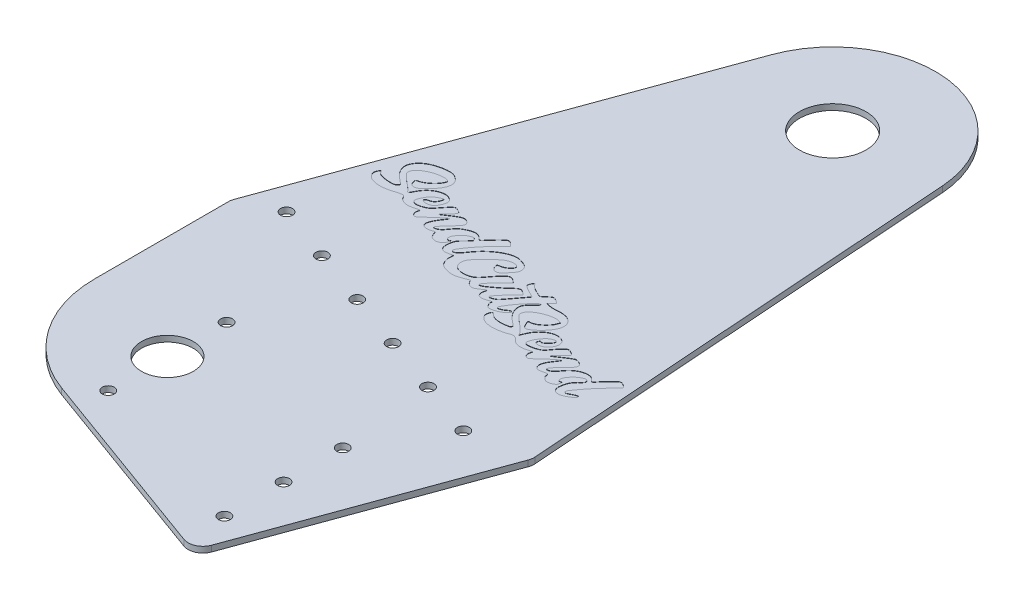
from build123d import *

# Parameters (mm, degrees)
SKETCH1_R                  = 14.2875
SKETCH1_R_2                = 11.1125
SKETCH1_R_3                = 2.5527
BOSS_EXTRUDE1_DEPTH        = 2.54
F_7_0_201_DIAMETER_HOLE1_D = 5.1054
CUT_EXTRUDE1_DEPTH         = 0.127


with BuildPart() as part:
    # Sketch1 → Boss-Extrude1 (new body)
    with BuildSketch(Plane(origin=(0, 0, 0), x_dir=(1, 0, 0), z_dir=(0, 1, 0))):
        with BuildLine():
            Line((0, 79.961539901), (0, 137.226043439))
            ThreePointArc((0, 137.226043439), (0.096470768, 138.328709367), (0.382951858, 139.397871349))
            Line((0.382951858, 139.397871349), (8.68731164, 162.213912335))
            Line((8.68731164, 162.213912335), (61.897095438, 308.406591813))
            ThreePointArc((61.897095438, 308.406591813), (109.5024689, 337.025784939), (147.412775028, 296.428513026))
            Line((147.412775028, 296.428513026), (160.751422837, 108.18172413))
            ThreePointArc((160.751422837, 108.18172413), (160.705914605, 106.852067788), (160.384352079, 105.56107804))
            Line((160.384352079, 105.56107804), (124.135089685, 5.967048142))
            ThreePointArc((124.135089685, 5.967048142), (120.851667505, 2.383821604), (115.996213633, 2.17182791))
            Line((115.996213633, 2.17182791), (33.425376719, 32.225154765))
            ThreePointArc((33.425376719, 32.225154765), (9.18707615, 50.823856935), (0, 79.961539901))
        make_face()
        with Locations(Location((103.379027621, 293.308403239, 0), (0, 0, 270))):
            Circle(SKETCH1_R, mode=Mode.SUBTRACT)
        with Locations(Location((44.45, 66.621712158, 0), (0, 0, 270))):
            Circle(SKETCH1_R_2, mode=Mode.SUBTRACT)
        with Locations(Location((44.45, 92.021712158, 0), (0, 0, 270))):
            Circle(SKETCH1_R_3, mode=Mode.SUBTRACT)
        with Locations(Location((44.45, 41.221712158, 0), (0, 0, 270))):
            Circle(SKETCH1_R_3, mode=Mode.SUBTRACT)
    extrude(amount=BOSS_EXTRUDE1_DEPTH)

    # 7 _0.201_ Diameter Hole1 (through all)
    with Locations(Plane(origin=(0, 0, 0), x_dir=(-1, 0, 0), z_dir=(0, -1, 0))):
        with Locations((-135.618714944, 102.499602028), (-111.750522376, 111.186913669), (-87.882329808, 119.874225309), (-64.01413724, 128.56153695), (-40.145944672, 137.24884859), (-16.277752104, 145.936160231), (-116.079027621, 70.264108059), (-116.079027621, 44.864108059), (-116.079027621, 19.464108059)):
            Hole(F_7_0_201_DIAMETER_HOLE1_D / 2)

    # Sketch7 → Cut-Extrude1 (cut)
    with BuildSketch(Plane(origin=(0, 2.54, 0), x_dir=(1, 0, 0), z_dir=(0, 1, 0))):
        with BuildLine():
            Line((62.076099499, 169.389914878), (62.514373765, 170.567044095))
            Line((62.514373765, 170.567044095), (61.586655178, 170.262230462))
            ThreePointArc((61.586655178, 170.262230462), (60.985434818, 170.31702595), (60.613751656, 170.792757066))
            ThreePointArc((60.613751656, 170.792757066), (60.559055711, 171.624223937), (60.815399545, 172.417077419))
            ThreePointArc((60.815399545, 172.417077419), (61.639993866, 173.691529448), (62.639781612, 174.833723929))
            ThreePointArc((62.639781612, 174.833723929), (63.679633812, 175.661233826), (64.871791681, 176.248451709))
            ThreePointArc((64.871791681, 176.248451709), (65.099079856, 176.328434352), (65.328232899, 176.402905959))
            ThreePointArc((65.328232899, 176.402905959), (65.537680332, 176.464533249), (65.748990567, 176.519434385))
            ThreePointArc((65.748990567, 176.519434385), (65.925606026, 176.559822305), (66.103240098, 176.595464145))
            ThreePointArc((66.103240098, 176.595464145), (66.178363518, 176.599313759), (66.251843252, 176.583217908))
            ThreePointArc((66.251843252, 176.583217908), (66.357924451, 176.524027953), (66.440024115, 176.434494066))
            ThreePointArc((66.440024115, 176.434494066), (66.590015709, 176.197743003), (66.731621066, 175.955882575))
            ThreePointArc((66.731621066, 175.955882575), (66.865503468, 175.708537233), (66.991385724, 175.457026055))
            ThreePointArc((66.991385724, 175.457026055), (67.017480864, 175.354291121), (67.00166206, 175.249480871))
            ThreePointArc((67.00166206, 175.249480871), (66.987526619, 175.22046471), (66.967691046, 175.195003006))
            Line((66.967691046, 175.195003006), (66.479583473, 174.688563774))
            ThreePointArc((66.479583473, 174.688563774), (66.201240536, 174.401518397), (65.921664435, 174.115673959))
            ThreePointArc((65.921664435, 174.115673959), (65.593555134, 173.782552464), (65.264545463, 173.450320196))
            ThreePointArc((65.264545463, 173.450320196), (64.65377447, 172.811457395), (64.067657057, 172.149903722))
            ThreePointArc((64.067657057, 172.149903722), (63.717771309, 171.683587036), (63.428601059, 171.177373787))
            ThreePointArc((63.428601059, 171.177373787), (63.215744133, 170.658844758), (63.0742109, 170.116489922))
            ThreePointArc((63.0742109, 170.116489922), (62.944743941, 169.332574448), (62.853767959, 168.543265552))
            ThreePointArc((62.853767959, 168.543265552), (62.842100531, 167.636825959), (62.97036833, 166.739431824))
            ThreePointArc((62.97036833, 166.739431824), (63.232071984, 166.091038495), (63.688945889, 165.561728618))
            ThreePointArc((63.688945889, 165.561728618), (64.290700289, 165.209453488), (64.974100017, 165.070994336))
            ThreePointArc((64.974100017, 165.070994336), (65.87566197, 165.109953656), (66.760144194, 165.288903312))
            ThreePointArc((66.760144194, 165.288903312), (67.04136363, 165.366968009), (67.323658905, 165.441048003))
            ThreePointArc((67.323658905, 165.441048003), (67.562615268, 165.498966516), (67.802868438, 165.55124569))
            ThreePointArc((67.802868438, 165.55124569), (68.002078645, 165.591015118), (68.201710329, 165.628611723))
            ThreePointArc((68.201710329, 165.628611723), (68.234260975, 165.622293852), (68.253909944, 165.595584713))
            ThreePointArc((68.253909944, 165.595584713), (68.261610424, 165.555018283), (68.26322337, 165.513758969))
            ThreePointArc((68.26322337, 165.513758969), (68.256279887, 165.326490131), (68.248634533, 165.139248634))
            ThreePointArc((68.248634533, 165.139248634), (68.238353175, 164.919063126), (68.2263207, 164.698966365))
            ThreePointArc((68.2263207, 164.698966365), (68.210944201, 164.448389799), (68.19421696, 164.197899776))
            ThreePointArc((68.19421696, 164.197899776), (68.187930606, 163.572595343), (68.25570298, 162.950942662))
            ThreePointArc((68.25570298, 162.950942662), (68.398465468, 162.310034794), (68.606068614, 161.687102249))
            ThreePointArc((68.606068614, 161.687102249), (68.866428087, 161.113452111), (69.186141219, 160.570639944))
            ThreePointArc((69.186141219, 160.570639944), (69.525559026, 160.137603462), (69.92917637, 159.763680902))
            ThreePointArc((69.92917637, 159.763680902), (70.466971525, 159.397497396), (71.050629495, 159.10999546))
            ThreePointArc((71.050629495, 159.10999546), (71.823044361, 158.825820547), (72.613497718, 158.596553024))
            ThreePointArc((72.613497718, 158.596553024), (73.43584942, 158.41929053), (74.268555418, 158.299770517))
            ThreePointArc((74.268555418, 158.299770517), (74.978307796, 158.26418709), (75.687446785, 158.310409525))
            ThreePointArc((75.687446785, 158.310409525), (76.037646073, 158.362788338), (76.384679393, 158.433151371))
            ThreePointArc((76.384679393, 158.433151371), (76.847607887, 158.544808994), (77.308005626, 158.666481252))
            ThreePointArc((77.308005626, 158.666481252), (77.798827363, 158.807573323), (78.286518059, 158.959134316))
            ThreePointArc((78.286518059, 158.959134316), (78.731971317, 159.109578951), (79.173136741, 159.272168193))
            Line((79.173136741, 159.272168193), (81.212299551, 160.055577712))
            Line((81.212299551, 160.055577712), (81.563880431, 159.301610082))
            ThreePointArc((81.563880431, 159.301610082), (81.7858593, 158.91888467), (82.072263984, 158.581652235))
            ThreePointArc((82.072263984, 158.581652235), (82.441698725, 158.263763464), (82.85025398, 157.998023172))
            ThreePointArc((82.85025398, 157.998023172), (83.274383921, 157.798102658), (83.722059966, 157.658673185))
            ThreePointArc((83.722059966, 157.658673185), (84.113032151, 157.612820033), (84.504080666, 157.658017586))
            ThreePointArc((84.504080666, 157.658017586), (84.704717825, 157.716644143), (84.897976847, 157.796288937))
            ThreePointArc((84.897976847, 157.796288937), (85.190157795, 157.940782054), (85.477858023, 158.09400263))
            ThreePointArc((85.477858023, 158.09400263), (85.799871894, 158.278112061), (86.116229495, 158.471779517))
            ThreePointArc((86.116229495, 158.471779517), (86.425022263, 158.673917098), (86.727482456, 158.88541274))
            ThreePointArc((86.727482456, 158.88541274), (87.010268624, 159.085729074), (87.296697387, 159.280801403))
            ThreePointArc((87.296697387, 159.280801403), (87.551055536, 159.445614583), (87.809847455, 159.603374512))
            ThreePointArc((87.809847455, 159.603374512), (88.025908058, 159.728525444), (88.244111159, 159.849902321))
            ThreePointArc((88.244111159, 159.849902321), (88.311309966, 159.870360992), (88.381119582, 159.862560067))
            ThreePointArc((88.381119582, 159.862560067), (88.424417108, 159.831307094), (88.441443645, 159.780695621))
            ThreePointArc((88.441443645, 159.780695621), (88.438680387, 159.659394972), (88.427011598, 159.538625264))
            ThreePointArc((88.427011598, 159.538625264), (88.400044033, 159.378215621), (88.362408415, 159.219968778))
            ThreePointArc((88.362408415, 159.219968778), (88.308041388, 159.036094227), (88.246173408, 158.854605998))
            ThreePointArc((88.246173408, 158.854605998), (88.175764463, 158.628210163), (88.127170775, 158.396151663))
            ThreePointArc((88.127170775, 158.396151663), (88.098728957, 158.152181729), (88.091257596, 157.906673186))
            ThreePointArc((88.091257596, 157.906673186), (88.104822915, 157.659437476), (88.139289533, 157.414240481))
            ThreePointArc((88.139289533, 157.414240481), (88.194014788, 157.177184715), (88.269735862, 156.945977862))
            ThreePointArc((88.269735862, 156.945977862), (88.380437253, 156.679086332), (88.507919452, 156.419790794))
            ThreePointArc((88.507919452, 156.419790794), (88.615909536, 156.257826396), (88.753714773, 156.120334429))
            ThreePointArc((88.753714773, 156.120334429), (88.915784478, 156.012693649), (89.095825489, 155.938948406))
            ThreePointArc((89.095825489, 155.938948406), (89.376240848, 155.864830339), (89.660777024, 155.808568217))
            ThreePointArc((89.660777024, 155.808568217), (89.907920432, 155.781557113), (90.156535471, 155.781719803))
            ThreePointArc((90.156535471, 155.781719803), (90.485680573, 155.80787544), (90.813201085, 155.849719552))
            ThreePointArc((90.813201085, 155.849719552), (91.163543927, 155.911391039), (91.510635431, 155.98930745))
            ThreePointArc((91.510635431, 155.98930745), (91.830199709, 156.078714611), (92.144110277, 156.186302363))
            ThreePointArc((92.144110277, 156.186302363), (92.681338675, 156.383695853), (93.221187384, 156.573806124))
            ThreePointArc((93.221187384, 156.573806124), (93.434095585, 156.628177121), (93.653016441, 156.647144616))
            ThreePointArc((93.653016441, 156.647144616), (93.754036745, 156.609731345), (93.805444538, 156.515063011))
            ThreePointArc((93.805444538, 156.515063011), (93.808105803, 156.352363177), (93.771443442, 156.193825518))
            ThreePointArc((93.771443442, 156.193825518), (93.715659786, 155.904517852), (93.752887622, 155.612242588))
            ThreePointArc((93.752887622, 155.612242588), (93.896843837, 155.202262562), (94.08290181, 154.809592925))
            ThreePointArc((94.08290181, 154.809592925), (94.313870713, 154.430567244), (94.583212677, 154.077775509))
            ThreePointArc((94.583212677, 154.077775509), (94.823690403, 153.859504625), (95.111996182, 153.710000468))
            ThreePointArc((95.111996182, 153.710000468), (95.607872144, 153.593770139), (96.117173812, 153.597547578))
            ThreePointArc((96.117173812, 153.597547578), (96.843705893, 153.720307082), (97.557690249, 153.902365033))
            ThreePointArc((97.557690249, 153.902365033), (98.335046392, 154.168977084), (99.088878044, 154.496242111))
            ThreePointArc((99.088878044, 154.496242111), (99.773408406, 154.866460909), (100.420507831, 155.298787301))
            ThreePointArc((100.420507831, 155.298787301), (100.716452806, 155.524575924), (101.004960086, 155.759793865))
            ThreePointArc((101.004960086, 155.759793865), (101.250782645, 155.97699109), (101.48611788, 156.205509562))
            ThreePointArc((101.48611788, 156.205509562), (101.665501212, 156.395781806), (101.836888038, 156.593287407))
            ThreePointArc((101.836888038, 156.593287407), (101.884060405, 156.686280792), (101.886160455, 156.790533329))
            ThreePointArc((101.886160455, 156.790533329), (101.81113355, 156.983449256), (101.677199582, 157.14126967))
            ThreePointArc((101.677199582, 157.14126967), (101.505007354, 157.237514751), (101.309348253, 157.262630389))
            ThreePointArc((101.309348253, 157.262630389), (101.037569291, 157.21498634), (100.782780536, 157.109078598))
            ThreePointArc((100.782780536, 157.109078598), (100.450500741, 156.907569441), (100.135844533, 156.679518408))
            ThreePointArc((100.135844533, 156.679518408), (99.724983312, 156.380037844), (99.292414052, 156.112868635))
            ThreePointArc((99.292414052, 156.112868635), (98.844251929, 155.881976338), (98.379358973, 155.686950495))
            ThreePointArc((98.379358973, 155.686950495), (97.986884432, 155.557588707), (97.585414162, 155.459648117))
            ThreePointArc((97.585414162, 155.459648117), (97.387336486, 155.474704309), (97.22647781, 155.591263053))
            ThreePointArc((97.22647781, 155.591263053), (97.073438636, 155.972384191), (97.151320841, 156.375631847))
            ThreePointArc((97.151320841, 156.375631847), (97.711080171, 157.407320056), (98.311678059, 158.415780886))
            ThreePointArc((98.311678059, 158.415780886), (99.130040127, 159.662563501), (100.006520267, 160.869197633))
            ThreePointArc((100.006520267, 160.869197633), (101.072241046, 162.221774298), (102.179192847, 163.540820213))
            ThreePointArc((102.179192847, 163.540820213), (102.84356579, 164.298754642), (103.517113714, 165.048547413))
            ThreePointArc((103.517113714, 165.048547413), (103.884004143, 165.423555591), (104.277261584, 165.77081386))
            ThreePointArc((104.277261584, 165.77081386), (104.534381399, 165.949071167), (104.816796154, 166.083712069))
            ThreePointArc((104.816796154, 166.083712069), (105.05023939, 166.127613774), (105.284320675, 166.087252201))
            ThreePointArc((105.284320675, 166.087252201), (105.351659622, 166.02133717), (105.346459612, 165.927250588))
            ThreePointArc((105.346459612, 165.927250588), (105.228966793, 165.724553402), (105.093938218, 165.533090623))
            ThreePointArc((105.093938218, 165.533090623), (104.848307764, 165.232899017), (104.586793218, 164.946438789))
            ThreePointArc((104.586793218, 164.946438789), (104.173603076, 164.524654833), (103.753608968, 164.109645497))
            ThreePointArc((103.753608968, 164.109645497), (103.049424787, 163.39758697), (102.373776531, 162.658396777))
            ThreePointArc((102.373776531, 162.658396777), (101.989554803, 162.152235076), (101.681460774, 161.596443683))
            ThreePointArc((101.681460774, 161.596443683), (101.505079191, 161.093387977), (101.429381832, 160.565708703))
            ThreePointArc((101.429381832, 160.565708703), (101.436881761, 159.925999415), (101.516888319, 159.291268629))
            ThreePointArc((101.516888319, 159.291268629), (101.712260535, 158.518519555), (102.006780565, 157.777864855))
            ThreePointArc((102.006780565, 157.777864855), (102.418510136, 157.014758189), (102.905634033, 156.297427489))
            ThreePointArc((102.905634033, 156.297427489), (103.545814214, 155.521894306), (104.249740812, 154.803723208))
            ThreePointArc((104.249740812, 154.803723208), (105.148760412, 154.002786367), (106.086684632, 153.247780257))
            ThreePointArc((106.086684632, 153.247780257), (106.643076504, 152.78422981), (107.158763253, 152.275783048))
            ThreePointArc((107.158763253, 152.275783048), (107.302662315, 151.970761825), (107.242679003, 151.638877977))
            ThreePointArc((107.242679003, 151.638877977), (106.985390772, 151.336449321), (106.625012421, 151.169752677))
            ThreePointArc((106.625012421, 151.169752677), (105.72515923, 150.99386554), (104.817927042, 150.861193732))
            ThreePointArc((104.817927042, 150.861193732), (103.87665349, 150.78105085), (102.93204479, 150.7695102))
            ThreePointArc((102.93204479, 150.7695102), (102.076114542, 150.831742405), (101.230216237, 150.976467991))
            ThreePointArc((101.230216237, 150.976467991), (100.514797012, 151.177390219), (99.826264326, 151.456884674))
            ThreePointArc((99.826264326, 151.456884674), (99.295254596, 151.773539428), (98.834592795, 152.185889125))
            ThreePointArc((98.834592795, 152.185889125), (98.552759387, 152.472909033), (98.253253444, 152.741435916))
            ThreePointArc((98.253253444, 152.741435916), (98.086978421, 152.821730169), (97.902549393, 152.812758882))
            ThreePointArc((97.902549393, 152.812758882), (97.728552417, 152.716259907), (97.60855714, 152.55755221))
            ThreePointArc((97.60855714, 152.55755221), (97.420718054, 152.132837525), (97.252129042, 151.700120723))
            ThreePointArc((97.252129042, 151.700120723), (97.120424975, 150.565164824), (97.513877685, 149.492473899))
            ThreePointArc((97.513877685, 149.492473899), (98.408438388, 148.50652004), (99.556768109, 147.832960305))
            ThreePointArc((99.556768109, 147.832960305), (101.308303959, 147.323477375), (103.124764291, 147.156376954))
            ThreePointArc((103.124764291, 147.156376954), (105.245384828, 147.294030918), (107.333578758, 147.688272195))
            ThreePointArc((107.333578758, 147.688272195), (107.725435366, 147.790413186), (108.115716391, 147.898418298))
            ThreePointArc((108.115716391, 147.898418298), (108.487933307, 148.007879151), (108.858227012, 148.123679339))
            ThreePointArc((108.858227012, 148.123679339), (109.170509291, 148.226990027), (109.481128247, 148.335199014))
            ThreePointArc((109.481128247, 148.335199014), (109.640411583, 148.400591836), (109.792936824, 148.480488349))
            ThreePointArc((109.792936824, 148.480488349), (110.158362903, 148.638407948), (110.550997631, 148.704079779))
            ThreePointArc((110.550997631, 148.704079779), (110.999125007, 148.685902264), (111.43768483, 148.592020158))
            ThreePointArc((111.43768483, 148.592020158), (111.891154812, 148.414255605), (112.311725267, 148.168581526))
            ThreePointArc((112.311725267, 148.168581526), (112.696235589, 147.857436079), (113.030584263, 147.492921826))
            ThreePointArc((113.030584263, 147.492921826), (113.516831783, 146.980166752), (114.087617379, 146.563563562))
            ThreePointArc((114.087617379, 146.563563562), (114.742714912, 146.241018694), (115.441794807, 146.030127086))
            ThreePointArc((115.441794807, 146.030127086), (116.248690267, 145.917044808), (117.063465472, 145.92008631))
            ThreePointArc((117.063465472, 145.92008631), (117.991499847, 146.03453308), (118.904500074, 146.236464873))
            ThreePointArc((118.904500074, 146.236464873), (119.297661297, 146.341504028), (119.691667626, 146.443327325))
            ThreePointArc((119.691667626, 146.443327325), (120.035021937, 146.5282979), (120.379405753, 146.608994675))
            ThreePointArc((120.379405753, 146.608994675), (120.673320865, 146.675133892), (120.967577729, 146.739735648))
            ThreePointArc((120.967577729, 146.739735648), (121.024521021, 146.743891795), (121.080380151, 146.732077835))
            ThreePointArc((121.080380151, 146.732077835), (121.112505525, 146.706664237), (121.123079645, 146.667090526))
            ThreePointArc((121.123079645, 146.667090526), (121.113780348, 146.559677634), (121.098643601, 146.452930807))
            ThreePointArc((121.098643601, 146.452930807), (121.07098753, 146.313741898), (121.035576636, 146.176321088))
            ThreePointArc((121.035576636, 146.176321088), (120.986573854, 146.016456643), (120.932098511, 145.858373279))
            ThreePointArc((120.932098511, 145.858373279), (120.837360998, 145.489763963), (120.815840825, 145.109783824))
            ThreePointArc((120.815840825, 145.109783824), (120.866288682, 144.717472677), (120.983868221, 144.339811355))
            ThreePointArc((120.983868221, 144.339811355), (121.160273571, 144.000288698), (121.394848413, 143.698015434))
            ThreePointArc((121.394848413, 143.698015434), (121.661791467, 143.471981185), (121.974137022, 143.314531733))
            ThreePointArc((121.974137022, 143.314531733), (122.191255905, 143.27080428), (122.411585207, 143.293336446))
            ThreePointArc((122.411585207, 143.293336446), (122.666552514, 143.382514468), (122.902959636, 143.513177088))
            ThreePointArc((122.902959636, 143.513177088), (123.258014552, 143.771039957), (123.591900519, 144.055780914))
            ThreePointArc((123.591900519, 144.055780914), (124.205225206, 144.629089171), (124.810961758, 145.210409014))
            ThreePointArc((124.810961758, 145.210409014), (125.635334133, 145.988621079), (126.482379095, 146.742092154))
            ThreePointArc((126.482379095, 146.742092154), (127.433022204, 147.544412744), (128.401415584, 148.325216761))
            ThreePointArc((128.401415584, 148.325216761), (129.340999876, 149.05981006), (130.286125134, 149.787260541))
            ThreePointArc((130.286125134, 149.787260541), (130.428120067, 149.816862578), (130.540190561, 149.724780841))
            ThreePointArc((130.540190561, 149.724780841), (130.54915896, 149.678093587), (130.534959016, 149.632722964))
            ThreePointArc((130.534959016, 149.632722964), (130.380262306, 149.382226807), (130.223884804, 149.132776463))
            ThreePointArc((130.223884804, 149.132776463), (130.036067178, 148.841001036), (129.843247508, 148.552506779))
            ThreePointArc((129.843247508, 148.552506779), (129.613486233, 148.218988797), (129.380109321, 147.887990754))
            ThreePointArc((129.380109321, 147.887990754), (128.803092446, 147.033618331), (128.27048311, 146.150879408))
            ThreePointArc((128.27048311, 146.150879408), (127.895820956, 145.410994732), (127.594715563, 144.638248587))
            ThreePointArc((127.594715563, 144.638248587), (127.428110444, 144.009827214), (127.342845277, 143.365311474))
            ThreePointArc((127.342845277, 143.365311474), (127.372858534, 142.851054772), (127.530162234, 142.360528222))
            ThreePointArc((127.530162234, 142.360528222), (127.743377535, 141.978324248), (128.009594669, 141.630949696))
            ThreePointArc((128.009594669, 141.630949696), (128.272849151, 141.410270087), (128.588685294, 141.275177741))
            ThreePointArc((128.588685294, 141.275177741), (129.003068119, 141.209884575), (129.422118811, 141.229193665))
            ThreePointArc((129.422118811, 141.229193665), (130.112073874, 141.348499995), (130.795504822, 141.500796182))
            ThreePointArc((130.795504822, 141.500796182), (131.340854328, 141.632133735), (131.887974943, 141.755886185))
            ThreePointArc((131.887974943, 141.755886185), (132.110954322, 141.787184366), (132.33610154, 141.784336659))
            ThreePointArc((132.33610154, 141.784336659), (132.47510977, 141.743288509), (132.587447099, 141.651699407))
            ThreePointArc((132.587447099, 141.651699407), (132.691105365, 141.497311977), (132.763030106, 141.325826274))
            ThreePointArc((132.763030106, 141.325826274), (132.799309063, 141.201126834), (132.831341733, 141.075269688))
            ThreePointArc((132.831341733, 141.075269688), (132.857559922, 140.953957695), (132.879045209, 140.831718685))
            ThreePointArc((132.879045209, 140.831718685), (132.893187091, 140.728099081), (132.903399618, 140.624018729))
            ThreePointArc((132.903399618, 140.624018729), (132.902402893, 140.565828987), (132.89031835, 140.508899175))
            ThreePointArc((132.89031835, 140.508899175), (132.88403432, 140.448738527), (132.901802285, 140.390919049))
            ThreePointArc((132.901802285, 140.390919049), (132.972760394, 140.267087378), (133.048878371, 140.146358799))
            ThreePointArc((133.048878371, 140.146358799), (133.150312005, 140.000349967), (133.258503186, 139.859275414))
            ThreePointArc((133.258503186, 139.859275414), (133.38618993, 139.705960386), (133.518918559, 139.556988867))
            ThreePointArc((133.518918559, 139.556988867), (133.883912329, 139.221748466), (134.299490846, 138.951746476))
            ThreePointArc((134.299490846, 138.951746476), (134.738976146, 138.766257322), (135.205264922, 138.665617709))
            ThreePointArc((135.205264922, 138.665617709), (135.714708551, 138.648358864), (136.219686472, 138.717842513))
            ThreePointArc((136.219686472, 138.717842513), (136.779359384, 138.878487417), (137.316911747, 139.10226858))
            ThreePointArc((137.316911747, 139.10226858), (137.672278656, 139.28361384), (138.020147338, 139.478957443))
            ThreePointArc((138.020147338, 139.478957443), (138.214734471, 139.616723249), (138.383376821, 139.785256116))
            ThreePointArc((138.383376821, 139.785256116), (138.507214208, 139.965861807), (138.592633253, 140.167499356))
            ThreePointArc((138.592633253, 140.167499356), (138.676354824, 140.474412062), (138.738886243, 140.786332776))
            ThreePointArc((138.738886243, 140.786332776), (138.777596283, 141.046627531), (138.807965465, 141.308026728))
            ThreePointArc((138.807965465, 141.308026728), (138.809051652, 141.447230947), (138.784685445, 141.584290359))
            ThreePointArc((138.784685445, 141.584290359), (138.745048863, 141.651198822), (138.676875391, 141.688617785))
            ThreePointArc((138.676875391, 141.688617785), (138.585042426, 141.694793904), (138.496299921, 141.67037658))
            ThreePointArc((138.496299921, 141.67037658), (138.245223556, 141.585322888), (137.981654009, 141.556958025))
            ThreePointArc((137.981654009, 141.556958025), (137.746132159, 141.593136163), (137.531802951, 141.69726296))
            ThreePointArc((137.531802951, 141.69726296), (137.360364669, 141.858574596), (137.245409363, 142.063995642))
            ThreePointArc((137.245409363, 142.063995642), (137.18320656, 142.315734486), (137.180101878, 142.575025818))
            ThreePointArc((137.180101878, 142.575025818), (137.318540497, 143.243918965), (137.588269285, 143.871477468))
            ThreePointArc((137.588269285, 143.871477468), (138.048267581, 144.611142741), (138.579131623, 145.301712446))
            ThreePointArc((138.579131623, 145.301712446), (139.224928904, 145.992508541), (139.932530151, 146.619847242))
            ThreePointArc((139.932530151, 146.619847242), (140.663482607, 147.146469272), (141.447089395, 147.590971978))
            ThreePointArc((141.447089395, 147.590971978), (141.872271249, 147.782255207), (142.311086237, 147.93976803))
            ThreePointArc((142.311086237, 147.93976803), (142.630008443, 148.002843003), (142.955003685, 147.994601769))
            ThreePointArc((142.955003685, 147.994601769), (143.20423146, 147.918838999), (143.417138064, 147.768754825))
            ThreePointArc((143.417138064, 147.768754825), (143.602089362, 147.541857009), (143.731276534, 147.279177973))
            ThreePointArc((143.731276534, 147.279177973), (143.769430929, 147.102790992), (143.760730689, 146.922534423))
            ThreePointArc((143.760730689, 146.922534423), (143.706341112, 146.732608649), (143.615285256, 146.557283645))
            ThreePointArc((143.615285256, 146.557283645), (143.435526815, 146.309397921), (143.23267276, 146.08002778))
            ThreePointArc((143.23267276, 146.08002778), (142.830658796, 145.674592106), (142.421668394, 145.276195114))
            ThreePointArc((142.421668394, 145.276195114), (142.049761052, 144.907611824), (141.690834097, 144.526376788))
            ThreePointArc((141.690834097, 144.526376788), (141.406907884, 144.194880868), (141.143163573, 143.847112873))
            ThreePointArc((141.143163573, 143.847112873), (140.925300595, 143.518409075), (140.730159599, 143.175727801))
            ThreePointArc((140.730159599, 143.175727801), (140.558754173, 142.821014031), (140.411620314, 142.455564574))
            ThreePointArc((140.411620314, 142.455564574), (140.000754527, 141.089005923), (139.748020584, 139.684577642))
            ThreePointArc((139.748020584, 139.684577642), (139.77462793, 138.657888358), (140.097521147, 137.68293256))
            ThreePointArc((140.097521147, 137.68293256), (140.617787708, 137.039476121), (141.357571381, 136.668755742))
            ThreePointArc((141.357571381, 136.668755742), (142.34158636, 136.545808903), (143.324901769, 136.674230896))
            ThreePointArc((143.324901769, 136.674230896), (143.930823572, 136.866099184), (144.514705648, 137.117169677))
            ThreePointArc((144.514705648, 137.117169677), (145.230560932, 137.490228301), (145.927205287, 137.898037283))
            ThreePointArc((145.927205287, 137.898037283), (146.567178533, 138.312514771), (147.189611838, 138.752894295))
            ThreePointArc((147.189611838, 138.752894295), (147.450320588, 139.012164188), (147.625121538, 139.335636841))
            ThreePointArc((147.625121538, 139.335636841), (147.66831646, 139.580039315), (147.625508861, 139.824509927))
            ThreePointArc((147.625508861, 139.824509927), (147.503357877, 139.981601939), (147.312279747, 140.037170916))
            ThreePointArc((147.312279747, 140.037170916), (146.92809182, 139.988948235), (146.559791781, 139.869445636))
            ThreePointArc((146.559791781, 139.869445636), (145.919183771, 139.578507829), (145.28953141, 139.264563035))
            ThreePointArc((145.28953141, 139.264563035), (144.757539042, 138.992974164), (144.22094649, 138.730591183))
            ThreePointArc((144.22094649, 138.730591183), (143.922050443, 138.604340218), (143.612717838, 138.506404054))
            ThreePointArc((143.612717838, 138.506404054), (143.429336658, 138.478951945), (143.244425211, 138.492737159))
            ThreePointArc((143.244425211, 138.492737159), (143.113889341, 138.550874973), (143.023413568, 138.661481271))
            ThreePointArc((143.023413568, 138.661481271), (142.91191489, 139.241621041), (143.106379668, 139.799453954))
            ThreePointArc((143.106379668, 139.799453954), (144.286575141, 141.488273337), (145.50646037, 143.148650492))
            ThreePointArc((145.50646037, 143.148650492), (146.980693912, 145.031699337), (148.524436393, 146.858197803))
            ThreePointArc((148.524436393, 146.858197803), (150.184655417, 148.685845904), (151.906041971, 150.456002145))
            ThreePointArc((151.906041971, 150.456002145), (152.504712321, 151.05737518), (153.096993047, 151.665042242))
            ThreePointArc((153.096993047, 151.665042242), (153.389903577, 151.989224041), (153.661121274, 152.331760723))
            ThreePointArc((153.661121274, 152.331760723), (153.792302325, 152.53993542), (153.89094745, 152.765355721))
            ThreePointArc((153.89094745, 152.765355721), (153.90512711, 152.924465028), (153.841665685, 153.071057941))
            ThreePointArc((153.841665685, 153.071057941), (153.63076883, 153.307554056), (153.388535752, 153.511835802))
            ThreePointArc((153.388535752, 153.511835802), (153.034906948, 153.75383123), (152.667620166, 153.9745472))
            ThreePointArc((152.667620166, 153.9745472), (152.299035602, 154.167935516), (151.920065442, 154.340084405))
            ThreePointArc((151.920065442, 154.340084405), (151.667742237, 154.416522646), (151.405080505, 154.43929586))
            ThreePointArc((151.405080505, 154.43929586), (151.107033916, 154.380132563), (150.848489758, 154.220486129))
            ThreePointArc((150.848489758, 154.220486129), (150.045484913, 153.488321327), (149.253554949, 152.744191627))
            ThreePointArc((149.253554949, 152.744191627), (148.412258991, 151.919459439), (147.593814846, 151.072044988))
            ThreePointArc((147.593814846, 151.072044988), (146.861074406, 150.264879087), (146.156594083, 149.432933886))
            ThreePointArc((146.156594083, 149.432933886), (145.799826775, 149.012010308), (145.428383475, 148.603979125))
            ThreePointArc((145.428383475, 148.603979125), (145.233235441, 148.450619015), (145.001743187, 148.361101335))
            ThreePointArc((145.001743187, 148.361101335), (144.804298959, 148.366712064), (144.633488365, 148.465906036))
            ThreePointArc((144.633488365, 148.465906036), (144.402784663, 148.718365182), (144.201416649, 148.994790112))
            ThreePointArc((144.201416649, 148.994790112), (143.893819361, 149.366783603), (143.508494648, 149.657507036))
            ThreePointArc((143.508494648, 149.657507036), (143.005365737, 149.903183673), (142.471047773, 150.070515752))
            ThreePointArc((142.471047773, 150.070515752), (141.847143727, 150.17256117), (141.215236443, 150.191606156))
            ThreePointArc((141.215236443, 150.191606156), (140.544397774, 150.130740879), (139.8841922, 149.997108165))
            ThreePointArc((139.8841922, 149.997108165), (139.076782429, 149.74477526), (138.297656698, 149.415312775))
            ThreePointArc((138.297656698, 149.415312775), (137.547232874, 149.007701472), (136.840246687, 148.528688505))
            ThreePointArc((136.840246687, 148.528688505), (136.143749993, 147.954086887), (135.502156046, 147.318766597))
            ThreePointArc((135.502156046, 147.318766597), (134.847038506, 146.559396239), (134.243649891, 145.758306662))
            ThreePointArc((134.243649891, 145.758306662), (133.893244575, 145.273954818), (133.529532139, 144.799514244))
            ThreePointArc((133.529532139, 144.799514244), (133.245270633, 144.463255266), (132.938900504, 144.14700845))
            ThreePointArc((132.938900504, 144.14700845), (132.668863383, 143.908783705), (132.378720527, 143.695504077))
            ThreePointArc((132.378720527, 143.695504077), (132.083061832, 143.518862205), (131.770999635, 143.373144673))
            ThreePointArc((131.770999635, 143.373144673), (131.251102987, 143.231020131), (130.7123491, 143.215652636))
            ThreePointArc((130.7123491, 143.215652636), (130.456459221, 143.376064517), (130.434657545, 143.677289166))
            ThreePointArc((130.434657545, 143.677289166), (130.79629879, 144.373155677), (131.266993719, 145.000420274))
            ThreePointArc((131.266993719, 145.000420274), (132.330651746, 146.169433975), (133.422645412, 147.312023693))
            ThreePointArc((133.422645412, 147.312023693), (134.334576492, 148.260561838), (135.228722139, 149.22588379))
            ThreePointArc((135.228722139, 149.22588379), (135.670578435, 149.76697259), (136.052634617, 150.351820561))
            ThreePointArc((136.052634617, 150.351820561), (136.222271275, 150.746269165), (136.293749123, 151.169656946))
            ThreePointArc((136.293749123, 151.169656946), (136.24891505, 151.551653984), (136.082974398, 151.898634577))
            ThreePointArc((136.082974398, 151.898634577), (135.842309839, 152.185418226), (135.555407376, 152.425941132))
            ThreePointArc((135.555407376, 152.425941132), (135.174655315, 152.664106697), (134.771529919, 152.862058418))
            ThreePointArc((134.771529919, 152.862058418), (134.349950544, 153.017909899), (133.914671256, 153.12994023))
            ThreePointArc((133.914671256, 153.12994023), (133.539517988, 153.173283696), (133.162472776, 153.15194036))
            ThreePointArc((133.162472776, 153.15194036), (132.967401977, 153.105618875), (132.783906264, 153.024825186))
            ThreePointArc((132.783906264, 153.024825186), (132.320523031, 152.763926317), (131.860956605, 152.496361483))
            ThreePointArc((131.860956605, 152.496361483), (131.314576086, 152.165822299), (130.774642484, 151.824853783))
            ThreePointArc((130.774642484, 151.824853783), (130.186534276, 151.439485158), (129.604043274, 151.045677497))
            ThreePointArc((129.604043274, 151.045677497), (129.0380303, 150.659002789), (128.470194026, 150.275010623))
            ThreePointArc((128.470194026, 150.275010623), (127.985533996, 149.951630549), (127.498404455, 149.631982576))
            ThreePointArc((127.498404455, 149.631982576), (127.069171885, 149.35312271), (126.639533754, 149.074888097))
            ThreePointArc((126.639533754, 149.074888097), (126.601736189, 149.061381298), (126.561878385, 149.066118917))
            ThreePointArc((126.561878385, 149.066118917), (126.519441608, 149.112579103), (126.533354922, 149.173945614))
            ThreePointArc((126.533354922, 149.173945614), (126.776839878, 149.455616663), (127.024963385, 149.733210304))
            ThreePointArc((127.024963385, 149.733210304), (127.405118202, 150.143104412), (127.793458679, 150.545251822))
            ThreePointArc((127.793458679, 150.545251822), (128.443193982, 151.201436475), (129.096131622, 151.854434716))
            ThreePointArc((129.096131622, 151.854434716), (129.422147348, 152.1855279), (129.741391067, 152.523155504))
            ThreePointArc((129.741391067, 152.523155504), (130.008357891, 152.820613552), (130.265754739, 153.126390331))
            ThreePointArc((130.265754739, 153.126390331), (130.468598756, 153.380419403), (130.66631701, 153.638458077))
            ThreePointArc((130.66631701, 153.638458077), (130.696681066, 153.71693357), (130.681612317, 153.799718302))
            ThreePointArc((130.681612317, 153.799718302), (130.513805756, 154.059802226), (130.289700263, 154.273295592))
            ThreePointArc((130.289700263, 154.273295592), (129.888084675, 154.554403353), (129.469241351, 154.809132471))
            ThreePointArc((129.469241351, 154.809132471), (129.037159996, 155.035529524), (128.591630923, 155.234159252))
            ThreePointArc((128.591630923, 155.234159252), (128.308873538, 155.307936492), (128.016663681, 155.30506962))
            ThreePointArc((128.016663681, 155.30506962), (127.675515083, 155.208794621), (127.371572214, 155.026394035))
            ThreePointArc((127.371572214, 155.026394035), (126.914414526, 154.638368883), (126.481808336, 154.223147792))
            ThreePointArc((126.481808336, 154.223147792), (125.925804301, 153.627075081), (125.399927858, 153.0042612))
            ThreePointArc((125.399927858, 153.0042612), (124.740208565, 152.16351677), (124.099423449, 151.308253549))
            ThreePointArc((124.099423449, 151.308253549), (123.724228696, 150.811126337), (123.334605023, 150.325225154))
            ThreePointArc((123.334605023, 150.325225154), (123.048901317, 150.00871762), (122.736636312, 149.718382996))
            ThreePointArc((122.736636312, 149.718382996), (122.436752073, 149.489616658), (122.114110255, 149.294253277))
            ThreePointArc((122.114110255, 149.294253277), (121.711829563, 149.095530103), (121.29765337, 148.922964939))
            ThreePointArc((121.29765337, 148.922964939), (120.659304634, 148.699002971), (120.010438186, 148.507638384))
            ThreePointArc((120.010438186, 148.507638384), (119.37505065, 148.356621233), (118.732177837, 148.241564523))
            ThreePointArc((118.732177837, 148.241564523), (118.176205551, 148.175013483), (117.617253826, 148.14173898))
            ThreePointArc((117.617253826, 148.14173898), (117.243952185, 148.166056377), (116.8818991, 148.260199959))
            ThreePointArc((116.8818991, 148.260199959), (116.319932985, 148.741962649), (116.214583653, 149.47463087))
            ThreePointArc((116.214583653, 149.47463087), (116.60072466, 150.752073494), (117.177555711, 151.955497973))
            ThreePointArc((117.177555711, 151.955497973), (118.056127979, 153.278075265), (119.093145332, 154.480445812))
            ThreePointArc((119.093145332, 154.480445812), (120.071406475, 155.255083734), (121.212607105, 155.759781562))
            ThreePointArc((121.212607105, 155.759781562), (121.455803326, 155.826498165), (121.70169492, 155.882469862))
            ThreePointArc((121.70169492, 155.882469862), (121.856640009, 155.900603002), (122.012413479, 155.892152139))
            ThreePointArc((122.012413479, 155.892152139), (122.12417889, 155.859942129), (122.222560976, 155.797894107))
            ThreePointArc((122.222560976, 155.797894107), (122.310347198, 155.705418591), (122.376342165, 155.596318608))
            ThreePointArc((122.376342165, 155.596318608), (122.465799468, 155.113625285), (122.310019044, 154.648084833))
            ThreePointArc((122.310019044, 154.648084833), (121.79737103, 153.943528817), (121.213016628, 153.297202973))
            ThreePointArc((121.213016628, 153.297202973), (120.583078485, 152.736212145), (119.895254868, 152.247917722))
            ThreePointArc((119.895254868, 152.247917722), (119.473802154, 152.143525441), (119.073222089, 152.311023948))
            ThreePointArc((119.073222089, 152.311023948), (118.994620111, 152.360824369), (118.904776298, 152.385040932))
            ThreePointArc((118.904776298, 152.385040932), (118.822245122, 152.377019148), (118.750112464, 152.336121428))
            ThreePointArc((118.750112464, 152.336121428), (118.66486315, 152.243694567), (118.599791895, 152.136103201))
            ThreePointArc((118.599791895, 152.136103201), (118.513895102, 151.943669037), (118.437161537, 151.74740104))
            ThreePointArc((118.437161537, 151.74740104), (118.359078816, 151.512782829), (118.294176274, 151.274182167))
            ThreePointArc((118.294176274, 151.274182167), (118.281425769, 151.138616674), (118.307696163, 151.005011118))
            ThreePointArc((118.307696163, 151.005011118), (118.368666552, 150.896784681), (118.463039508, 150.816012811))
            ThreePointArc((118.463039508, 150.816012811), (118.63984408, 150.722389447), (118.824498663, 150.645396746))
            ThreePointArc((118.824498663, 150.645396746), (119.712133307, 150.468839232), (120.611777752, 150.567366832))
            ThreePointArc((120.611777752, 150.567366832), (121.559752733, 150.935454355), (122.406165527, 151.499130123))
            ThreePointArc((122.406165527, 151.499130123), (123.158398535, 152.269068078), (123.740963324, 153.174207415))
            ThreePointArc((123.740963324, 153.174207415), (124.100558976, 154.140488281), (124.231077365, 155.163216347))
            ThreePointArc((124.231077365, 155.163216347), (124.201819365, 155.597953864), (124.104128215, 156.022582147))
            ThreePointArc((124.104128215, 156.022582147), (123.943871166, 156.402369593), (123.715660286, 156.745648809))
            ThreePointArc((123.715660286, 156.745648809), (123.406690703, 157.06805043), (123.048313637, 157.334454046))
            ThreePointArc((123.048313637, 157.334454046), (122.585124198, 157.590441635), (122.098427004, 157.798287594))
            ThreePointArc((122.098427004, 157.798287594), (121.257951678, 158.021478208), (120.390646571, 158.084681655))
            ThreePointArc((120.390646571, 158.084681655), (119.46559047, 157.994391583), (118.565162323, 157.763934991))
            ThreePointArc((118.565162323, 157.763934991), (117.611234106, 157.366654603), (116.7193786, 156.844730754))
            ThreePointArc((116.7193786, 156.844730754), (115.801726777, 156.152873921), (114.956356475, 155.374349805))
            ThreePointArc((114.956356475, 155.374349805), (114.548661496, 154.934769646), (114.167722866, 154.471809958))
            ThreePointArc((114.167722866, 154.471809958), (113.840296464, 154.015875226), (113.546587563, 153.537524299))
            ThreePointArc((113.546587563, 153.537524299), (113.207987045, 152.903721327), (112.900081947, 152.254451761))
            ThreePointArc((112.900081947, 152.254451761), (112.42287833, 151.16579795), (111.958304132, 150.071695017))
            ThreePointArc((111.958304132, 150.071695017), (111.939323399, 150.057505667), (111.91772606, 150.067260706))
            ThreePointArc((111.91772606, 150.067260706), (111.846787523, 150.17073676), (111.778455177, 150.275952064))
            ThreePointArc((111.778455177, 150.275952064), (111.690987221, 150.419257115), (111.608002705, 150.565204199))
            ThreePointArc((111.608002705, 150.565204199), (111.509853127, 150.747801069), (111.4147464, 150.932001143))
            ThreePointArc((111.4147464, 150.932001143), (111.246308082, 151.21592928), (111.041389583, 151.474763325))
            ThreePointArc((111.041389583, 151.474763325), (110.652706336, 151.890815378), (110.252015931, 152.295316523))
            ThreePointArc((110.252015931, 152.295316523), (109.740891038, 152.782636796), (109.216382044, 153.25552158))
            ThreePointArc((109.216382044, 153.25552158), (108.603769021, 153.782530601), (107.981434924, 154.298024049))
            ThreePointArc((107.981434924, 154.298024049), (107.397924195, 154.779199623), (106.821329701, 155.268641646))
            ThreePointArc((106.821329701, 155.268641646), (106.28900935, 155.735228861), (105.764922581, 156.211045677))
            ThreePointArc((105.764922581, 156.211045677), (105.333586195, 156.615592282), (104.908334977, 157.026530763))
            ThreePointArc((104.908334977, 157.026530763), (104.72548382, 157.228770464), (104.568139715, 157.451432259))
            ThreePointArc((104.568139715, 157.451432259), (104.331732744, 158.051664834), (104.321947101, 158.696700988))
            ThreePointArc((104.321947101, 158.696700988), (104.530320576, 159.411643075), (104.901055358, 160.057489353))
            ThreePointArc((104.901055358, 160.057489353), (105.548242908, 160.793679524), (106.306061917, 161.415401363))
            ThreePointArc((106.306061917, 161.415401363), (107.337245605, 162.066264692), (108.420230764, 162.626716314))
            ThreePointArc((108.420230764, 162.626716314), (109.378766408, 163.038340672), (110.359692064, 163.393319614))
            ThreePointArc((110.359692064, 163.393319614), (111.300405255, 163.666648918), (112.25803627, 163.873029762))
            ThreePointArc((112.25803627, 163.873029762), (113.096749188, 163.989274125), (113.94199928, 164.039318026))
            ThreePointArc((113.94199928, 164.039318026), (114.58460117, 163.995839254), (115.20984846, 163.841264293))
            Line((115.20984846, 163.841264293), (116.356965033, 163.448649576))
            Line((116.356965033, 163.448649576), (115.8812603, 162.188871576))
            ThreePointArc((115.8812603, 162.188871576), (115.56503894, 161.509858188), (115.151170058, 160.885544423))
            ThreePointArc((115.151170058, 160.885544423), (114.535329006, 160.149112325), (113.867730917, 159.459253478))
            ThreePointArc((113.867730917, 159.459253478), (113.148853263, 158.816728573), (112.38543882, 158.227812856))
            ThreePointArc((112.38543882, 158.227812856), (111.728295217, 157.824220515), (111.021168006, 157.516494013))
            ThreePointArc((111.021168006, 157.516494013), (110.759496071, 157.428408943), (110.495204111, 157.348528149))
            ThreePointArc((110.495204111, 157.348528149), (110.246724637, 157.282802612), (109.995890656, 157.226729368))
            ThreePointArc((109.995890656, 157.226729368), (109.786430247, 157.188044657), (109.575714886, 157.156912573))
            ThreePointArc((109.575714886, 157.156912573), (109.469748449, 157.155930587), (109.366558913, 157.180050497))
            ThreePointArc((109.366558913, 157.180050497), (109.297763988, 157.199672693), (109.226880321, 157.209330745))
            ThreePointArc((109.226880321, 157.209330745), (109.159871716, 157.207840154), (109.09411849, 157.19484446))
            ThreePointArc((109.09411849, 157.19484446), (109.038731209, 157.172621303), (108.988862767, 157.139837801))
            ThreePointArc((108.988862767, 157.139837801), (108.951966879, 157.100564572), (108.926887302, 157.052870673))
            ThreePointArc((108.926887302, 157.052870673), (108.885507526, 156.806815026), (108.934659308, 156.562193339))
            ThreePointArc((108.934659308, 156.562193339), (109.172909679, 155.995509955), (109.430567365, 155.437382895))
            ThreePointArc((109.430567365, 155.437382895), (109.70762259, 154.888277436), (110.003763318, 154.349225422))
            ThreePointArc((110.003763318, 154.349225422), (110.167501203, 154.152987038), (110.388719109, 154.024993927))
            ThreePointArc((110.388719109, 154.024993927), (111.239099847, 153.921102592), (112.048621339, 154.201487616))
            ThreePointArc((112.048621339, 154.201487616), (113.308016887, 155.076494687), (114.48112442, 156.064185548))
            ThreePointArc((114.48112442, 156.064185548), (115.687390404, 157.288153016), (116.774533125, 158.619052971))
            ThreePointArc((116.774533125, 158.619052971), (117.568311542, 159.868883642), (118.173163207, 161.220295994))
            ThreePointArc((118.173163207, 161.220295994), (118.44679796, 162.507197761), (118.357234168, 163.819817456))
            ThreePointArc((118.357234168, 163.819817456), (117.907681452, 164.989852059), (117.113119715, 165.959259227))
            ThreePointArc((117.113119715, 165.959259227), (115.928063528, 166.75975752), (114.576836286, 167.228095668))
            ThreePointArc((114.576836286, 167.228095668), (112.904829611, 167.434733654), (111.221315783, 167.370805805))
            ThreePointArc((111.221315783, 167.370805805), (110.79535049, 167.329379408), (110.367999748, 167.306272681))
            ThreePointArc((110.367999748, 167.306272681), (109.888697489, 167.298010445), (109.409367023, 167.304431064))
            ThreePointArc((109.409367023, 167.304431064), (108.951224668, 167.32469757), (108.493930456, 167.359152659))
            ThreePointArc((108.493930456, 167.359152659), (108.136564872, 167.403085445), (107.782690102, 167.469515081))
            Line((107.782690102, 167.469515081), (106.287524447, 167.799440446))
            Line((106.287524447, 167.799440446), (107.266421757, 168.711352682))
            ThreePointArc((107.266421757, 168.711352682), (107.456317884, 168.889701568), (107.64475791, 169.069588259))
            ThreePointArc((107.64475791, 169.069588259), (107.808669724, 169.229236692), (107.970661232, 169.390833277))
            ThreePointArc((107.970661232, 169.390833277), (108.106472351, 169.528770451), (108.241450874, 169.667522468))
            ThreePointArc((108.241450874, 169.667522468), (108.269372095, 169.703223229), (108.289247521, 169.743955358))
            ThreePointArc((108.289247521, 169.743955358), (108.294211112, 169.869533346), (108.225374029, 169.974680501))
            ThreePointArc((108.225374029, 169.974680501), (107.864425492, 170.25991382), (107.496290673, 170.535809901))
            ThreePointArc((107.496290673, 170.535809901), (107.107054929, 170.80711634), (106.706458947, 171.061349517))
            ThreePointArc((106.706458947, 171.061349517), (106.390134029, 171.232184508), (106.058693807, 171.371444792))
            ThreePointArc((106.058693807, 171.371444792), (105.831530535, 171.434655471), (105.597322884, 171.461959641))
            ThreePointArc((105.597322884, 171.461959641), (105.385729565, 171.447566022), (105.181938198, 171.388846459))
            ThreePointArc((105.181938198, 171.388846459), (104.930504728, 171.266665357), (104.697182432, 171.112692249))
            ThreePointArc((104.697182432, 171.112692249), (104.321212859, 170.818815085), (103.954012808, 170.514051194))
            ThreePointArc((103.954012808, 170.514051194), (103.686787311, 170.286199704), (103.418942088, 170.05907704))
            ThreePointArc((103.418942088, 170.05907704), (103.171217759, 169.850274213), (102.922826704, 169.642264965))
            ThreePointArc((102.922826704, 169.642264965), (102.703702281, 169.4598916), (102.484056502, 169.278146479))
            ThreePointArc((102.484056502, 169.278146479), (102.382703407, 169.196354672), (102.279602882, 169.11677684))
            ThreePointArc((102.279602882, 169.11677684), (101.942459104, 168.98118652), (101.5829312, 169.034010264))
            ThreePointArc((101.5829312, 169.034010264), (100.578455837, 169.489925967), (99.589147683, 169.977880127))
            ThreePointArc((99.589147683, 169.977880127), (98.618800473, 170.503450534), (97.672637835, 171.071406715))
            ThreePointArc((97.672637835, 171.071406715), (97.168926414, 171.465586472), (96.754810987, 171.953040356))
            Line((96.754810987, 171.953040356), (96.172279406, 172.79914973))
            Line((96.172279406, 172.79914973), (95.666854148, 171.945381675))
            ThreePointArc((95.666854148, 171.945381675), (95.566124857, 171.765703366), (95.473970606, 171.581479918))
            ThreePointArc((95.473970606, 171.581479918), (95.388898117, 171.389936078), (95.312450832, 171.194789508))
            ThreePointArc((95.312450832, 171.194789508), (95.252490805, 171.018680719), (95.200658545, 170.840010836))
            ThreePointArc((95.200658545, 170.840010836), (95.176704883, 170.715626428), (95.170139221, 170.589126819))
            ThreePointArc((95.170139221, 170.589126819), (95.226632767, 170.315113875), (95.378851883, 170.08037156))
            ThreePointArc((95.378851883, 170.08037156), (95.718053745, 169.754279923), (96.084503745, 169.459139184))
            ThreePointArc((96.084503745, 169.459139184), (96.626671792, 169.087429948), (97.192308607, 168.75251363))
            ThreePointArc((97.192308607, 168.75251363), (97.964738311, 168.343505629), (98.74864026, 167.956940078))
            ThreePointArc((98.74864026, 167.956940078), (99.089272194, 167.792802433), (99.428140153, 167.625053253))
            ThreePointArc((99.428140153, 167.625053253), (99.71238102, 167.479325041), (99.994021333, 167.328632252))
            ThreePointArc((99.994021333, 167.328632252), (100.231009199, 167.198196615), (100.467190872, 167.066306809))
            ThreePointArc((100.467190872, 167.066306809), (100.489553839, 167.040107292), (100.489650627, 167.005661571))
            ThreePointArc((100.489650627, 167.005661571), (100.425302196, 166.863246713), (100.340311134, 166.732100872))
            Line((100.340311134, 166.732100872), (97.668554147, 163.222752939))
            ThreePointArc((97.668554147, 163.222752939), (96.421777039, 161.588715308), (95.172775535, 159.9563773))
            ThreePointArc((95.172775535, 159.9563773), (94.834089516, 159.530865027), (94.479935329, 159.118137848))
            ThreePointArc((94.479935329, 159.118137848), (94.126917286, 158.779305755), (93.725385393, 158.499661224))
            ThreePointArc((93.725385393, 158.499661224), (93.190814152, 158.215729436), (92.634397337, 157.9774355))
            ThreePointArc((92.634397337, 157.9774355), (92.124734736, 157.806652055), (91.603185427, 157.676616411))
            ThreePointArc((91.603185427, 157.676616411), (91.370277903, 157.707061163), (91.206568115, 157.875500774))
            ThreePointArc((91.206568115, 157.875500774), (91.164140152, 158.12807696), (91.25756153, 158.366545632))
            ThreePointArc((91.25756153, 158.366545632), (91.879303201, 159.180303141), (92.515821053, 159.982555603))
            ThreePointArc((92.515821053, 159.982555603), (93.32692872, 160.956023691), (94.166516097, 161.905038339))
            ThreePointArc((94.166516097, 161.905038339), (95.187827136, 163.005624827), (96.228669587, 164.08775876))
            ThreePointArc((96.228669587, 164.08775876), (96.545951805, 164.412812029), (96.86219345, 164.738877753))
            ThreePointArc((96.86219345, 164.738877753), (97.132355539, 165.019736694), (97.401099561, 165.301952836))
            ThreePointArc((97.401099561, 165.301952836), (97.635396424, 165.54954387), (97.869388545, 165.797422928))
            ThreePointArc((97.869388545, 165.797422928), (97.892045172, 165.826965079), (97.90826543, 165.860475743))
            ThreePointArc((97.90826543, 165.860475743), (97.909922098, 165.891138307), (97.894234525, 165.917535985))
            ThreePointArc((97.894234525, 165.917535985), (97.773928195, 166.026034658), (97.652399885, 166.133162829))
            ThreePointArc((97.652399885, 166.133162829), (97.504019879, 166.259423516), (97.352700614, 166.38214624))
            ThreePointArc((97.352700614, 166.38214624), (97.172619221, 166.522560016), (96.990489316, 166.660306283))
            ThreePointArc((96.990489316, 166.660306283), (96.468810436, 167.007066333), (95.913070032, 167.296106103))
            ThreePointArc((95.913070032, 167.296106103), (95.500766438, 167.408830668), (95.073897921, 167.386822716))
            ThreePointArc((95.073897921, 167.386822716), (94.602072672, 167.226868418), (94.179742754, 166.96259227))
            ThreePointArc((94.179742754, 166.96259227), (93.484860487, 166.380238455), (92.81655063, 165.767572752))
            ThreePointArc((92.81655063, 165.767572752), (91.941271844, 164.958070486), (91.03766939, 164.180311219))
            ThreePointArc((91.03766939, 164.180311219), (89.975335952, 163.319524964), (88.892865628, 162.484202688))
            ThreePointArc((88.892865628, 162.484202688), (87.876969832, 161.736428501), (86.845112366, 161.010838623))
            ThreePointArc((86.845112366, 161.010838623), (86.22278761, 160.627440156), (85.565376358, 160.307920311))
            ThreePointArc((85.565376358, 160.307920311), (85.293069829, 160.195650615), (85.01825852, 160.089659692))
            ThreePointArc((85.01825852, 160.089659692), (84.90166187, 160.061710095), (84.781765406, 160.062602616))
            ThreePointArc((84.781765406, 160.062602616), (84.706359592, 160.095583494), (84.660468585, 160.163904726))
            ThreePointArc((84.660468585, 160.163904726), (84.628856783, 160.29575601), (84.61667073, 160.430795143))
            ThreePointArc((84.61667073, 160.430795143), (84.669600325, 160.790743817), (84.83523899, 161.114670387))
            ThreePointArc((84.83523899, 161.114670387), (85.44056277, 161.914185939), (86.064920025, 162.698927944))
            ThreePointArc((86.064920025, 162.698927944), (86.836979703, 163.61509508), (87.638251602, 164.505826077))
            ThreePointArc((87.638251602, 164.505826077), (88.531015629, 165.442136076), (89.447552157, 166.355188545))
            Line((89.447552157, 166.355188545), (91.364234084, 168.216116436))
            Line((91.364234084, 168.216116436), (90.631630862, 168.885995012))
            ThreePointArc((90.631630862, 168.885995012), (90.464050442, 169.028684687), (90.28680705, 169.159177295))
            ThreePointArc((90.28680705, 169.159177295), (90.073823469, 169.297558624), (89.854678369, 169.425959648))
            ThreePointArc((89.854678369, 169.425959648), (89.633424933, 169.542183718), (89.407012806, 169.648007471))
            ThreePointArc((89.407012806, 169.648007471), (89.214060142, 169.723628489), (89.015623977, 169.783397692))
            ThreePointArc((89.015623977, 169.783397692), (88.748130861, 169.832185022), (88.476411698, 169.842258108))
            ThreePointArc((88.476411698, 169.842258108), (88.243725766, 169.808353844), (88.024058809, 169.724457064))
            ThreePointArc((88.024058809, 169.724457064), (87.750386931, 169.561522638), (87.499009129, 169.365938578))
            ThreePointArc((87.499009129, 169.365938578), (87.050163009, 168.961015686), (86.610069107, 168.546597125))
            ThreePointArc((86.610069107, 168.546597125), (86.252765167, 168.190406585), (85.90836211, 167.821727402))
            ThreePointArc((85.90836211, 167.821727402), (85.472145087, 167.329749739), (85.044030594, 166.83070536))
            ThreePointArc((85.044030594, 166.83070536), (84.601410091, 166.297444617), (84.167470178, 165.757096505))
            ThreePointArc((84.167470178, 165.757096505), (83.786356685, 165.263443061), (83.41627331, 164.761467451))
            ThreePointArc((83.41627331, 164.761467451), (82.751418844, 163.888620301), (82.040862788, 163.05255589))
            ThreePointArc((82.040862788, 163.05255589), (81.463415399, 162.487695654), (80.817368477, 162.002787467))
            ThreePointArc((80.817368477, 162.002787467), (80.170628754, 161.646688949), (79.477779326, 161.391663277))
            ThreePointArc((79.477779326, 161.391663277), (78.629298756, 161.191800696), (77.766033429, 161.070815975))
            ThreePointArc((77.766033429, 161.070815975), (76.678357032, 161.041477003), (75.596332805, 161.156038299))
            ThreePointArc((75.596332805, 161.156038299), (74.693549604, 161.41023311), (73.861634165, 161.843302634))
            ThreePointArc((73.861634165, 161.843302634), (73.239374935, 162.375461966), (72.767835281, 163.044827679))
            ThreePointArc((72.767835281, 163.044827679), (72.483911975, 163.801154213), (72.403652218, 164.605020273))
            ThreePointArc((72.403652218, 164.605020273), (72.680930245, 166.076583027), (73.396403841, 167.392059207))
            ThreePointArc((73.396403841, 167.392059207), (75.013497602, 169.351993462), (76.766496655, 171.191376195))
            ThreePointArc((76.766496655, 171.191376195), (78.664783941, 172.914948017), (80.683685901, 174.495526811))
            ThreePointArc((80.683685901, 174.495526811), (82.110475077, 175.264459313), (83.689533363, 175.629917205))
            ThreePointArc((83.689533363, 175.629917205), (84.208375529, 175.652155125), (84.726774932, 175.621271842))
            ThreePointArc((84.726774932, 175.621271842), (85.144898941, 175.535672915), (85.540541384, 175.375604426))
            ThreePointArc((85.540541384, 175.375604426), (85.806560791, 175.189446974), (86.013349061, 174.939128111))
            ThreePointArc((86.013349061, 174.939128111), (86.116011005, 174.670218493), (86.111098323, 174.382420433))
            ThreePointArc((86.111098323, 174.382420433), (85.963178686, 173.961500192), (85.712027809, 173.592749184))
            ThreePointArc((85.712027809, 173.592749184), (85.278779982, 173.153871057), (84.803069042, 172.761421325))
            ThreePointArc((84.803069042, 172.761421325), (84.245316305, 172.388184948), (83.65371405, 172.071324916))
            ThreePointArc((83.65371405, 172.071324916), (83.087403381, 171.846913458), (82.496654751, 171.698305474))
            ThreePointArc((82.496654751, 171.698305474), (82.044714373, 171.611288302), (81.59444938, 171.51598075))
            ThreePointArc((81.59444938, 171.51598075), (81.439461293, 171.459941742), (81.303932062, 171.366168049))
            ThreePointArc((81.303932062, 171.366168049), (81.228145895, 171.256950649), (81.208654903, 171.125451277))
            ThreePointArc((81.208654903, 171.125451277), (81.239890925, 170.865712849), (81.29029524, 170.60900456))
            ThreePointArc((81.29029524, 170.60900456), (81.469535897, 170.06446356), (81.740351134, 169.559180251))
            ThreePointArc((81.740351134, 169.559180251), (82.072928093, 169.161050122), (82.488701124, 168.850811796))
            ThreePointArc((82.488701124, 168.850811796), (82.93488827, 168.665024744), (83.413786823, 168.599786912))
            ThreePointArc((83.413786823, 168.599786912), (83.904966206, 168.656705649), (84.368131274, 168.829838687))
            ThreePointArc((84.368131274, 168.829838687), (84.846319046, 169.130351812), (85.26889875, 169.505049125))
            ThreePointArc((85.26889875, 169.505049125), (85.938033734, 170.229388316), (86.581547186, 170.976582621))
            ThreePointArc((86.581547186, 170.976582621), (87.201901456, 171.75094182), (87.793743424, 172.547305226))
            ThreePointArc((87.793743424, 172.547305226), (88.121057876, 173.077597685), (88.373478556, 173.647359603))
            ThreePointArc((88.373478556, 173.647359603), (88.447639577, 173.888302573), (88.497142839, 174.135492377))
            ThreePointArc((88.497142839, 174.135492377), (88.52115078, 174.385027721), (88.519493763, 174.635709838))
            ThreePointArc((88.519493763, 174.635709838), (88.491387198, 174.901909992), (88.438249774, 175.164262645))
            ThreePointArc((88.438249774, 175.164262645), (88.354859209, 175.453818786), (88.252413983, 175.737194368))
            ThreePointArc((88.252413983, 175.737194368), (88.105581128, 176.069793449), (87.935462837, 176.391106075))
            ThreePointArc((87.935462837, 176.391106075), (87.778827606, 176.619296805), (87.588225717, 176.819986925))
            ThreePointArc((87.588225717, 176.819986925), (87.34152332, 177.015443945), (87.072499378, 177.178819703))
            ThreePointArc((87.072499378, 177.178819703), (86.614223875, 177.410483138), (86.1489489, 177.627746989))
            ThreePointArc((86.1489489, 177.627746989), (85.791009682, 177.779498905), (85.427209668, 177.916607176))
            ThreePointArc((85.427209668, 177.916607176), (85.023529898, 178.05248387), (84.615845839, 178.17582705))
            ThreePointArc((84.615845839, 178.17582705), (84.229069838, 178.279819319), (83.839222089, 178.371627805))
            ThreePointArc((83.839222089, 178.371627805), (83.539335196, 178.426401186), (83.23635564, 178.460100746))
            ThreePointArc((83.23635564, 178.460100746), (81.626479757, 178.41157627), (80.062827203, 178.02551193))
            ThreePointArc((80.062827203, 178.02551193), (78.233848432, 177.241564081), (76.505754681, 176.25493874))
            ThreePointArc((76.505754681, 176.25493874), (74.707456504, 174.950863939), (73.053456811, 173.468038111))
            ThreePointArc((73.053456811, 173.468038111), (71.530974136, 171.797582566), (70.179581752, 169.985922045))
            ThreePointArc((70.179581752, 169.985922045), (69.588743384, 169.148682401), (68.960457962, 168.339165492))
            ThreePointArc((68.960457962, 168.339165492), (68.463607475, 167.797662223), (67.905817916, 167.319167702))
            ThreePointArc((67.905817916, 167.319167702), (67.490095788, 167.067018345), (67.03121774, 166.906285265))
            ThreePointArc((67.03121774, 166.906285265), (66.66793279, 166.9078423), (66.34543078, 167.075087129))
            ThreePointArc((66.34543078, 167.075087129), (66.249683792, 167.179433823), (66.179725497, 167.30256609))
            ThreePointArc((66.179725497, 167.30256609), (66.145313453, 167.429747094), (66.147268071, 167.561486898))
            ThreePointArc((66.147268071, 167.561486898), (66.189923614, 167.74438899), (66.259342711, 167.91889876))
            ThreePointArc((66.259342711, 167.91889876), (66.409238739, 168.214950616), (66.568146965, 168.506264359))
            ThreePointArc((66.568146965, 168.506264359), (67.354266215, 169.810683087), (68.211299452, 171.069645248))
            ThreePointArc((68.211299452, 171.069645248), (69.31775204, 172.553008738), (70.469746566, 174.001288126))
            ThreePointArc((70.469746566, 174.001288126), (71.737580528, 175.498925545), (73.0498076, 176.957822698))
            ThreePointArc((73.0498076, 176.957822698), (74.347308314, 178.309944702), (75.69068299, 179.616499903))
            ThreePointArc((75.69068299, 179.616499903), (75.967508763, 179.878483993), (76.242436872, 180.142458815))
            ThreePointArc((76.242436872, 180.142458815), (76.480897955, 180.375572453), (76.716839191, 180.611236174))
            ThreePointArc((76.716839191, 180.611236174), (76.91569914, 180.813006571), (77.113556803, 181.015759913))
            ThreePointArc((77.113556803, 181.015759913), (77.150764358, 181.063180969), (77.177224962, 181.117338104))
            ThreePointArc((77.177224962, 181.117338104), (77.185034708, 181.236889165), (77.127340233, 181.341888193))
            ThreePointArc((77.127340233, 181.341888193), (76.781156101, 181.68101103), (76.428642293, 182.0135494))
            ThreePointArc((76.428642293, 182.0135494), (76.076553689, 182.329142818), (75.714529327, 182.633287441))
            ThreePointArc((75.714529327, 182.633287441), (75.499394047, 182.780245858), (75.262843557, 182.88944215))
            ThreePointArc((75.262843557, 182.88944215), (75.173288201, 182.915259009), (75.08104885, 182.928622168))
            ThreePointArc((75.08104885, 182.928622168), (74.956291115, 182.934412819), (74.83140777, 182.932938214))
            ThreePointArc((74.83140777, 182.932938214), (74.695533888, 182.923545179), (74.560402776, 182.906529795))
            ThreePointArc((74.560402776, 182.906529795), (74.433389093, 182.882594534), (74.308223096, 182.850363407))
            ThreePointArc((74.308223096, 182.850363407), (73.996613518, 182.717287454), (73.725039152, 182.51466193))
            ThreePointArc((73.725039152, 182.51466193), (72.9436587, 181.763045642), (72.171776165, 181.001678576))
            ThreePointArc((72.171776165, 181.001678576), (71.342507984, 180.155590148), (70.531396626, 179.29208004))
            ThreePointArc((70.531396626, 179.29208004), (69.792931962, 178.467712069), (69.076167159, 177.624408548))
            ThreePointArc((69.076167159, 177.624408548), (68.820563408, 177.334992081), (68.546981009, 177.062507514))
            ThreePointArc((68.546981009, 177.062507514), (68.385243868, 176.967746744), (68.198502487, 176.951432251))
            ThreePointArc((68.198502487, 176.951432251), (67.984267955, 177.011500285), (67.794763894, 177.128088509))
            ThreePointArc((67.794763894, 177.128088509), (67.330174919, 177.520218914), (66.873836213, 177.921920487))
            ThreePointArc((66.873836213, 177.921920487), (66.44165565, 178.248511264), (65.960415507, 178.497206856))
            ThreePointArc((65.960415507, 178.497206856), (65.44280696, 178.661698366), (64.904949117, 178.737097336))
            ThreePointArc((64.904949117, 178.737097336), (64.285041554, 178.727599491), (63.672598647, 178.631218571))
            ThreePointArc((63.672598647, 178.631218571), (62.943258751, 178.432765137), (62.23169771, 178.177811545))
            ThreePointArc((62.23169771, 178.177811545), (61.442111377, 177.836118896), (60.670720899, 177.455123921))
            ThreePointArc((60.670720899, 177.455123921), (60.081776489, 177.107320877), (59.530100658, 176.702998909))
            ThreePointArc((59.530100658, 176.702998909), (59.004621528, 176.233538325), (58.525710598, 175.716657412))
            ThreePointArc((58.525710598, 175.716657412), (57.940690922, 174.992109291), (57.386392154, 174.243797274))
            ThreePointArc((57.386392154, 174.243797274), (57.053131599, 173.788503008), (56.706211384, 173.343529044))
            ThreePointArc((56.706211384, 173.343529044), (56.425102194, 173.017042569), (56.122778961, 172.710095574))
            ThreePointArc((56.122778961, 172.710095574), (55.852842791, 172.474825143), (55.563856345, 172.263390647))
            ThreePointArc((55.563856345, 172.263390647), (55.273202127, 172.08969786), (54.966550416, 171.946122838))
            ThreePointArc((54.966550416, 171.946122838), (54.747480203, 171.863397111), (54.524343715, 171.792366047))
            ThreePointArc((54.524343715, 171.792366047), (54.321925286, 171.741881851), (54.116305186, 171.706636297))
            ThreePointArc((54.116305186, 171.706636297), (53.953528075, 171.691770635), (53.790079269, 171.690405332))
            ThreePointArc((53.790079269, 171.690405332), (53.703892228, 171.712450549), (53.635011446, 171.768750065))
            ThreePointArc((53.635011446, 171.768750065), (53.555335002, 171.962922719), (53.590462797, 172.169846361))
            ThreePointArc((53.590462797, 172.169846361), (53.783293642, 172.527442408), (54.009252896, 172.865082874))
            ThreePointArc((54.009252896, 172.865082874), (54.450539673, 173.432924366), (54.91774417, 173.979639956))
            ThreePointArc((54.91774417, 173.979639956), (55.871250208, 175.03657522), (56.832360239, 176.08660066))
            ThreePointArc((56.832360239, 176.08660066), (57.741724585, 177.094273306), (58.62939478, 178.121107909))
            ThreePointArc((58.62939478, 178.121107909), (59.011581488, 178.650622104), (59.308037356, 179.232486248))
            ThreePointArc((59.308037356, 179.232486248), (59.396067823, 179.641073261), (59.33285138, 180.05422746))
            ThreePointArc((59.33285138, 180.05422746), (59.121878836, 180.48258003), (58.812364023, 180.846167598))
            ThreePointArc((58.812364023, 180.846167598), (58.314339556, 181.224297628), (57.755334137, 181.50451831))
            ThreePointArc((57.755334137, 181.50451831), (57.215058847, 181.637944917), (56.658644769, 181.627775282))
            ThreePointArc((56.658644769, 181.627775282), (55.964889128, 181.462616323), (55.309212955, 181.18214685))
            ThreePointArc((55.309212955, 181.18214685), (54.328866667, 180.63014507), (53.375387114, 180.03293359))
            ThreePointArc((53.375387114, 180.03293359), (51.915722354, 179.071055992), (50.455505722, 178.110016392))
            ThreePointArc((50.455505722, 178.110016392), (50.21204172, 177.957022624), (49.962439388, 177.814262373))
            ThreePointArc((49.962439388, 177.814262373), (49.911717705, 177.823508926), (49.910054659, 177.875039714))
            ThreePointArc((49.910054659, 177.875039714), (50.106340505, 178.124025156), (50.312785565, 178.364654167))
            ThreePointArc((50.312785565, 178.364654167), (50.498959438, 178.571079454), (50.686790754, 178.775997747))
            ThreePointArc((50.686790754, 178.775997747), (50.960715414, 179.071611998), (51.235457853, 179.366466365))
            ThreePointArc((51.235457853, 179.366466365), (51.538808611, 179.690227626), (51.84304798, 180.013154))
            ThreePointArc((51.84304798, 180.013154), (52.133715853, 180.319848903), (52.42535745, 180.625618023))
            ThreePointArc((52.42535745, 180.625618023), (52.926867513, 181.171654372), (53.405658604, 181.737717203))
            ThreePointArc((53.405658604, 181.737717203), (53.558548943, 182.020292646), (53.598471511, 182.339088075))
            ThreePointArc((53.598471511, 182.339088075), (53.514036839, 182.621152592), (53.3132644, 182.836512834))
            ThreePointArc((53.3132644, 182.836512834), (52.792831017, 183.161600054), (52.252471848, 183.452365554))
            ThreePointArc((52.252471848, 183.452365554), (51.88927277, 183.624803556), (51.520086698, 183.784020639))
            ThreePointArc((51.520086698, 183.784020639), (51.320753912, 183.841128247), (51.113760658, 183.853319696))
            ThreePointArc((51.113760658, 183.853319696), (50.922566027, 183.818659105), (50.746390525, 183.736689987))
            ThreePointArc((50.746390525, 183.736689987), (50.467758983, 183.549524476), (50.200019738, 183.347083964))
            ThreePointArc((50.200019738, 183.347083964), (49.96856135, 183.147843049), (49.751770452, 182.932734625))
            ThreePointArc((49.751770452, 182.932734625), (49.398637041, 182.55058909), (49.051622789, 182.16287847))
            ThreePointArc((49.051622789, 182.16287847), (48.657144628, 181.707544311), (48.270193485, 181.245796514))
            ThreePointArc((48.270193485, 181.245796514), (47.885633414, 180.771636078), (47.508568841, 180.29149352))
            ThreePointArc((47.508568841, 180.29149352), (47.002976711, 179.650076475), (46.485086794, 179.01854717))
            ThreePointArc((46.485086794, 179.01854717), (46.136193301, 178.62944972), (45.761331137, 178.265304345))
            ThreePointArc((45.761331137, 178.265304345), (45.435660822, 177.997857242), (45.085437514, 177.763479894))
            ThreePointArc((45.085437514, 177.763479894), (44.686389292, 177.544403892), (44.271555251, 177.356929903))
            ThreePointArc((44.271555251, 177.356929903), (43.350851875, 177.022254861), (42.407927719, 176.756555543))
            ThreePointArc((42.407927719, 176.756555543), (41.661850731, 176.637326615), (40.906306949, 176.637272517))
            ThreePointArc((40.906306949, 176.637272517), (40.38128567, 176.748024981), (39.901790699, 176.988852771))
            ThreePointArc((39.901790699, 176.988852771), (39.586804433, 177.314985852), (39.430951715, 177.740766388))
            ThreePointArc((39.430951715, 177.740766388), (39.420728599, 178.216157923), (39.524571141, 178.680182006))
            ThreePointArc((39.524571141, 178.680182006), (39.812475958, 179.423775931), (40.142153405, 180.149815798))
            ThreePointArc((40.142153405, 180.149815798), (40.532540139, 180.890833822), (40.966976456, 181.606916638))
            ThreePointArc((40.966976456, 181.606916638), (41.356930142, 182.132985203), (41.809279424, 182.606474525))
            ThreePointArc((41.809279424, 182.606474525), (42.25537723, 182.981025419), (42.734959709, 183.311619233))
            ThreePointArc((42.734959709, 183.311619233), (43.340099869, 183.665080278), (43.963716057, 183.984817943))
            ThreePointArc((43.963716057, 183.984817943), (44.546699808, 184.249909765), (45.139605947, 184.491996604))
            ThreePointArc((45.139605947, 184.491996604), (45.33141934, 184.490548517), (45.470612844, 184.358565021))
            ThreePointArc((45.470612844, 184.358565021), (45.493486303, 184.280259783), (45.491847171, 184.198698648))
            ThreePointArc((45.491847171, 184.198698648), (45.457504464, 184.020461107), (45.416731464, 183.843583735))
            ThreePointArc((45.416731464, 183.843583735), (45.358596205, 183.629334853), (45.291812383, 183.417622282))
            ThreePointArc((45.291812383, 183.417622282), (45.210208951, 183.187810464), (45.121597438, 182.96060881))
            ThreePointArc((45.121597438, 182.96060881), (44.921360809, 182.539587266), (44.674740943, 182.143945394))
            ThreePointArc((44.674740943, 182.143945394), (44.391161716, 181.790259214), (44.066213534, 181.474158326))
            ThreePointArc((44.066213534, 181.474158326), (43.718834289, 181.212651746), (43.340648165, 180.998098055))
            ThreePointArc((43.340648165, 180.998098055), (42.954290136, 180.844901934), (42.549579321, 180.75029361))
            ThreePointArc((42.549579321, 180.75029361), (42.289402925, 180.700184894), (42.033306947, 180.632232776))
            ThreePointArc((42.033306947, 180.632232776), (41.832184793, 180.556955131), (41.642364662, 180.456530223))
            ThreePointArc((41.642364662, 180.456530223), (41.493291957, 180.347938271), (41.363086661, 180.217318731))
            ThreePointArc((41.363086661, 180.217318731), (41.259165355, 180.071491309), (41.181718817, 179.910037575))
            ThreePointArc((41.181718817, 179.910037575), (41.178833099, 179.702015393), (41.309813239, 179.540380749))
            ThreePointArc((41.309813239, 179.540380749), (41.653735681, 179.363832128), (42.018437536, 179.235595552))
            ThreePointArc((42.018437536, 179.235595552), (42.500459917, 179.130280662), (42.99112412, 179.078459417))
            ThreePointArc((42.99112412, 179.078459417), (43.464396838, 179.084090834), (43.933315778, 179.14838552))
            ThreePointArc((43.933315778, 179.14838552), (44.433539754, 179.292271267), (44.903722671, 179.515553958))
            ThreePointArc((44.903722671, 179.515553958), (45.350454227, 179.81983622), (45.748195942, 180.18583937))
            ThreePointArc((45.748195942, 180.18583937), (46.1377322, 180.656353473), (46.465617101, 181.171730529))
            ThreePointArc((46.465617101, 181.171730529), (46.787509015, 181.812722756), (47.058774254, 182.476726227))
            ThreePointArc((47.058774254, 182.476726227), (47.243211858, 183.068075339), (47.371655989, 183.674056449))
            ThreePointArc((47.371655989, 183.674056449), (47.393822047, 184.129706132), (47.312846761, 184.578650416))
            ThreePointArc((47.312846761, 184.578650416), (47.137939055, 184.974388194), (46.871116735, 185.314986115))
            ThreePointArc((46.871116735, 185.314986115), (46.458438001, 185.677075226), (46.004215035, 185.985447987))
            ThreePointArc((46.004215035, 185.985447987), (44.80931975, 186.469458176), (43.524829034, 186.579568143))
            ThreePointArc((43.524829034, 186.579568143), (42.070153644, 186.33718489), (40.693626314, 185.808032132))
            ThreePointArc((40.693626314, 185.808032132), (39.281911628, 184.932513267), (38.043497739, 183.825353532))
            ThreePointArc((38.043497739, 183.825353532), (36.964357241, 182.480258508), (36.107257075, 180.983861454))
            ThreePointArc((36.107257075, 180.983861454), (35.941069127, 180.643699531), (35.766582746, 180.307718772))
            ThreePointArc((35.766582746, 180.307718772), (35.609063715, 180.026852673), (35.44051885, 179.752461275))
            ThreePointArc((35.44051885, 179.752461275), (35.299810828, 179.540199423), (35.152922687, 179.332166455))
            ThreePointArc((35.152922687, 179.332166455), (35.093761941, 179.290046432), (35.021164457, 179.291968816))
            ThreePointArc((35.021164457, 179.291968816), (34.956732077, 179.322183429), (34.89870251, 179.363378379))
            ThreePointArc((34.89870251, 179.363378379), (34.804527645, 179.446829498), (34.713476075, 179.533677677))
            ThreePointArc((34.713476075, 179.533677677), (34.609811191, 179.640175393), (34.510214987, 179.75048753))
            ThreePointArc((34.510214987, 179.75048753), (34.410689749, 179.868894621), (34.315163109, 179.990550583))
            ThreePointArc((34.315163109, 179.990550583), (34.16179957, 180.17467948), (33.992343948, 180.344115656))
            ThreePointArc((33.992343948, 180.344115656), (33.571548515, 180.724651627), (33.147225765, 181.101250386))
            ThreePointArc((33.147225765, 181.101250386), (32.636158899, 181.545386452), (32.119991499, 181.983584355))
            ThreePointArc((32.119991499, 181.983584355), (31.557242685, 182.451378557), (30.990229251, 182.91399439))
            ThreePointArc((30.990229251, 182.91399439), (30.422938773, 183.381281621), (29.864408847, 183.859005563))
            ThreePointArc((29.864408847, 183.859005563), (29.351442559, 184.316387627), (28.848972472, 184.785276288))
            ThreePointArc((28.848972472, 184.785276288), (28.436927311, 185.186492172), (28.03291594, 185.595796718))
            ThreePointArc((28.03291594, 185.595796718), (27.859849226, 185.803949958), (27.719998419, 186.035729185))
            ThreePointArc((27.719998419, 186.035729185), (27.519466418, 186.705886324), (27.563387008, 187.404022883))
            ThreePointArc((27.563387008, 187.404022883), (27.844970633, 188.161140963), (28.293688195, 188.832832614))
            ThreePointArc((28.293688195, 188.832832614), (29.05379087, 189.595655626), (29.923452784, 190.230748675))
            ThreePointArc((29.923452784, 190.230748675), (31.119416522, 190.90645535), (32.36354206, 191.488744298))
            ThreePointArc((32.36354206, 191.488744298), (33.272424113, 191.830759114), (34.20549942, 192.099852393))
            ThreePointArc((34.20549942, 192.099852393), (35.214153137, 192.312847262), (36.234686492, 192.458658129))
            ThreePointArc((36.234686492, 192.458658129), (37.140793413, 192.528095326), (38.049493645, 192.538826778))
            ThreePointArc((38.049493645, 192.538826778), (38.574598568, 192.451854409), (39.053554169, 192.219688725))
            ThreePointArc((39.053554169, 192.219688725), (39.234262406, 192.084176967), (39.401008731, 191.931813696))
            ThreePointArc((39.401008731, 191.931813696), (39.48098236, 191.815279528), (39.514632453, 191.678007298))
            ThreePointArc((39.514632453, 191.678007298), (39.505071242, 191.506537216), (39.45648331, 191.341817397))
            ThreePointArc((39.45648331, 191.341817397), (39.306433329, 191.00320881), (39.146477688, 190.669165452))
            ThreePointArc((39.146477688, 190.669165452), (38.630846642, 189.778099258), (38.006869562, 188.959242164))
            ThreePointArc((38.006869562, 188.959242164), (37.228016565, 188.144262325), (36.374169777, 187.408225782))
            ThreePointArc((36.374169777, 187.408225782), (35.464330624, 186.766399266), (34.496323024, 186.216208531))
            ThreePointArc((34.496323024, 186.216208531), (33.583142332, 185.831108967), (32.625668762, 185.575286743))
            ThreePointArc((32.625668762, 185.575286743), (32.472387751, 185.534524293), (32.326027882, 185.473406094))
            ThreePointArc((32.326027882, 185.473406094), (32.244080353, 185.407375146), (32.197089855, 185.313208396))
            ThreePointArc((32.197089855, 185.313208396), (32.176822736, 185.171032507), (32.187045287, 185.027783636))
            ThreePointArc((32.187045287, 185.027783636), (32.250062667, 184.69819232), (32.320484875, 184.370103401))
            ThreePointArc((32.320484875, 184.370103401), (32.448110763, 183.944188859), (32.632662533, 183.539674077))
            ThreePointArc((32.632662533, 183.539674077), (32.85427, 183.210309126), (33.134539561, 182.92916839))
            ThreePointArc((33.134539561, 182.92916839), (33.441516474, 182.725882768), (33.78445958, 182.591905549))
            ThreePointArc((33.78445958, 182.591905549), (34.152617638, 182.530955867), (34.525485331, 182.545952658))
            ThreePointArc((34.525485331, 182.545952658), (35.370628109, 182.785514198), (36.122272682, 183.240142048))
            ThreePointArc((36.122272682, 183.240142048), (37.220285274, 184.185306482), (38.253829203, 185.200567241))
            ThreePointArc((38.253829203, 185.200567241), (39.270548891, 186.343653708), (40.206057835, 187.554103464))
            ThreePointArc((40.206057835, 187.554103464), (40.843996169, 188.583311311), (41.335166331, 189.690102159))
            ThreePointArc((41.335166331, 189.690102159), (41.567541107, 190.516793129), (41.67369086, 191.368936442))
            ThreePointArc((41.67369086, 191.368936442), (41.628053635, 192.123760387), (41.419849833, 192.850735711))
            ThreePointArc((41.419849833, 192.850735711), (41.048390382, 193.545550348), (40.542961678, 194.149943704))
            ThreePointArc((40.542961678, 194.149943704), (39.828249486, 194.765734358), (39.044543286, 195.290916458))
            ThreePointArc((39.044543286, 195.290916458), (37.837163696, 195.79757677), (36.539169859, 195.969861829))
            ThreePointArc((36.539169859, 195.969861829), (34.746289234, 195.87297145), (32.973877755, 195.585976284))
            ThreePointArc((32.973877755, 195.585976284), (31.137775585, 195.086153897), (29.363452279, 194.398498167))
            ThreePointArc((29.363452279, 194.398498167), (27.934925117, 193.611058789), (26.654266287, 192.600779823))
            ThreePointArc((26.654266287, 192.600779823), (25.662491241, 191.46006794), (24.930662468, 190.137468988))
            ThreePointArc((24.930662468, 190.137468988), (24.605311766, 188.848335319), (24.683524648, 187.521081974))
            ThreePointArc((24.683524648, 187.521081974), (25.185334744, 186.070996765), (26.020691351, 184.783852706))
            ThreePointArc((26.020691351, 184.783852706), (27.404977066, 183.300019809), (28.940541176, 181.973351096))
            ThreePointArc((28.940541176, 181.973351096), (29.468737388, 181.555914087), (29.988451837, 181.127963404))
            ThreePointArc((29.988451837, 181.127963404), (30.193724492, 180.920369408), (30.357491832, 180.678682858))
            ThreePointArc((30.357491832, 180.678682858), (30.407709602, 180.497643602), (30.371290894, 180.313332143))
            ThreePointArc((30.371290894, 180.313332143), (30.24439316, 180.097272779), (30.075933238, 179.9117844))
            ThreePointArc((30.075933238, 179.9117844), (29.367297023, 179.461906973), (28.551242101, 179.265414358))
            ThreePointArc((28.551242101, 179.265414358), (27.218942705, 179.229092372), (25.888662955, 179.31092607))
            ThreePointArc((25.888662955, 179.31092607), (24.560835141, 179.512237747), (23.256269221, 179.831237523))
            ThreePointArc((23.256269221, 179.831237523), (22.490641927, 180.196978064), (21.880287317, 180.786400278))
            ThreePointArc((21.880287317, 180.786400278), (21.651566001, 181.083753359), (21.414621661, 181.374596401))
            ThreePointArc((21.414621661, 181.374596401), (21.31561635, 181.448606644), (21.193989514, 181.470662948))
            ThreePointArc((21.193989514, 181.470662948), (21.075290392, 181.436024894), (20.984652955, 181.351917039))
            ThreePointArc((20.984652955, 181.351917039), (20.780489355, 181.038003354), (20.585222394, 180.71847966))
            ThreePointArc((20.585222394, 180.71847966), (20.244657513, 179.499767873), (20.559605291, 178.274186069))
            ThreePointArc((20.559605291, 178.274186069), (21.49315143, 177.13153269), (22.756561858, 176.369325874))
            ThreePointArc((22.756561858, 176.369325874), (24.774484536, 175.809532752), (26.863619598, 175.664981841))
            ThreePointArc((26.863619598, 175.664981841), (29.18662527, 175.908801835), (31.449565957, 176.487509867))
            ThreePointArc((31.449565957, 176.487509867), (31.828580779, 176.610532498), (32.209842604, 176.726404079))
            ThreePointArc((32.209842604, 176.726404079), (32.613138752, 176.841306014), (33.018240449, 176.949670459))
            ThreePointArc((33.018240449, 176.949670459), (33.387664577, 177.042085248), (33.758548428, 177.128455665))
            ThreePointArc((33.758548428, 177.128455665), (34.019155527, 177.1806114), (34.281894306, 177.220669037))
            ThreePointArc((34.281894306, 177.220669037), (34.610149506, 177.255904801), (34.939605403, 177.277161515))
            ThreePointArc((34.939605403, 177.277161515), (35.107201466, 177.262055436), (35.264923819, 177.20340142))
            ThreePointArc((35.264923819, 177.20340142), (35.407023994, 177.103666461), (35.52059207, 176.972358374))
            ThreePointArc((35.52059207, 176.972358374), (35.716722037, 176.668521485), (35.902412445, 176.358194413))
            ThreePointArc((35.902412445, 176.358194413), (36.382963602, 175.708975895), (36.998841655, 175.186378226))
            ThreePointArc((36.998841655, 175.186378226), (37.753070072, 174.782425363), (38.571007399, 174.531393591))
            ThreePointArc((38.571007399, 174.531393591), (39.556423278, 174.411412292), (40.548393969, 174.44928201))
            ThreePointArc((40.548393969, 174.44928201), (41.695583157, 174.643353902), (42.817808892, 174.950463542))
            ThreePointArc((42.817808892, 174.950463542), (43.068348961, 175.030544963), (43.320064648, 175.106850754))
            ThreePointArc((43.320064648, 175.106850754), (43.544410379, 175.170404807), (43.77007256, 175.229113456))
            ThreePointArc((43.77007256, 175.229113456), (43.958543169, 175.274607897), (44.147623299, 175.317498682))
            ThreePointArc((44.147623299, 175.317498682), (44.205766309, 175.321859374), (44.262818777, 175.309832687))
            ThreePointArc((44.262818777, 175.309832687), (44.297681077, 175.282987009), (44.310696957, 175.240955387))
            ThreePointArc((44.310696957, 175.240955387), (44.306504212, 175.137995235), (44.295353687, 175.035554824))
            ThreePointArc((44.295353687, 175.035554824), (44.271599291, 174.900591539), (44.239278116, 174.767419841))
            ThreePointArc((44.239278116, 174.767419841), (44.1932574, 174.613085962), (44.141175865, 174.460690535))
            ThreePointArc((44.141175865, 174.460690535), (44.041996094, 174.090173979), (44.008854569, 173.708047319))
            ThreePointArc((44.008854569, 173.708047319), (44.041696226, 173.319542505), (44.138530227, 172.941868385))
            ThreePointArc((44.138530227, 172.941868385), (44.292139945, 172.599163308), (44.502798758, 172.28825242))
            ThreePointArc((44.502798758, 172.28825242), (44.750505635, 172.043533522), (45.045240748, 171.858122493))
            ThreePointArc((45.045240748, 171.858122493), (45.269629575, 171.788380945), (45.504606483, 171.788668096))
            ThreePointArc((45.504606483, 171.788668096), (45.762289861, 171.856447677), (46.000253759, 171.97631418))
            ThreePointArc((46.000253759, 171.97631418), (46.372000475, 172.237257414), (46.721296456, 172.527566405))
            ThreePointArc((46.721296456, 172.527566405), (47.45937355, 173.200243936), (48.190775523, 173.880173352))
            ThreePointArc((48.190775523, 173.880173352), (49.064674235, 174.685802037), (49.953099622, 175.475382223))
            ThreePointArc((49.953099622, 175.475382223), (50.839321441, 176.23377775), (51.739975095, 176.974976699))
            ThreePointArc((51.739975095, 176.974976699), (52.57230312, 177.641924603), (53.40917864, 178.3031574))
            ThreePointArc((53.40917864, 178.3031574), (53.566138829, 178.371691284), (53.736628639, 178.35536282))
            ThreePointArc((53.736628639, 178.35536282), (53.759556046, 178.332104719), (53.756011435, 178.29963872))
            ThreePointArc((53.756011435, 178.29963872), (53.601547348, 178.050721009), (53.44552018, 177.80278008))
            ThreePointArc((53.44552018, 177.80278008), (53.255916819, 177.509266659), (53.061225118, 177.219103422))
            ThreePointArc((53.061225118, 177.219103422), (52.823477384, 176.875152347), (52.582222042, 176.533652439))
            ThreePointArc((52.582222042, 176.533652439), (52.082044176, 175.79536439), (51.618949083, 175.033268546))
            ThreePointArc((51.618949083, 175.033268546), (51.228761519, 174.302621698), (50.884327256, 173.549324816))
            ThreePointArc((50.884327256, 173.549324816), (50.636423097, 172.898809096), (50.433205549, 172.232978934))
            ThreePointArc((50.433205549, 172.232978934), (50.356848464, 171.763225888), (50.376439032, 171.287710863))
            ThreePointArc((50.376439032, 171.287710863), (50.528807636, 170.812215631), (50.82925109, 170.413410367))
            ThreePointArc((50.82925109, 170.413410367), (51.270609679, 170.093306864), (51.779384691, 169.897317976))
            ThreePointArc((51.779384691, 169.897317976), (52.45949486, 169.798443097), (53.146134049, 169.827644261))
            ThreePointArc((53.146134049, 169.827644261), (53.960849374, 169.9839615), (54.754150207, 170.226592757))
            ThreePointArc((54.754150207, 170.226592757), (55.035220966, 170.325002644), (55.318874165, 170.415700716))
            ThreePointArc((55.318874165, 170.415700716), (55.466705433, 170.44705915), (55.617731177, 170.452412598))
            ThreePointArc((55.617731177, 170.452412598), (55.70348793, 170.42747679), (55.769065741, 170.366850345))
            ThreePointArc((55.769065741, 170.366850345), (55.812724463, 170.273611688), (55.825842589, 170.171496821))
            ThreePointArc((55.825842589, 170.171496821), (55.830598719, 170.050840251), (55.851363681, 169.931888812))
            ThreePointArc((55.851363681, 169.931888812), (55.901491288, 169.740453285), (55.957931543, 169.550782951))
            ThreePointArc((55.957931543, 169.550782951), (56.030455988, 169.333695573), (56.110160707, 169.119140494))
            ThreePointArc((56.110160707, 169.119140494), (56.198051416, 168.904300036), (56.29277201, 168.692382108))
            ThreePointArc((56.29277201, 168.692382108), (56.785097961, 167.97340494), (57.482890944, 167.451487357))
            ThreePointArc((57.482890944, 167.451487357), (58.334510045, 167.161152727), (59.23386838, 167.13462204))
            ThreePointArc((59.23386838, 167.13462204), (60.15040083, 167.376610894), (60.966213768, 167.859352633))
            ThreePointArc((60.966213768, 167.859352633), (61.62548482, 168.548980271), (62.076099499, 169.389914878))
        make_face()
    extrude(amount=-CUT_EXTRUDE1_DEPTH, mode=Mode.SUBTRACT)


solid = part.part
